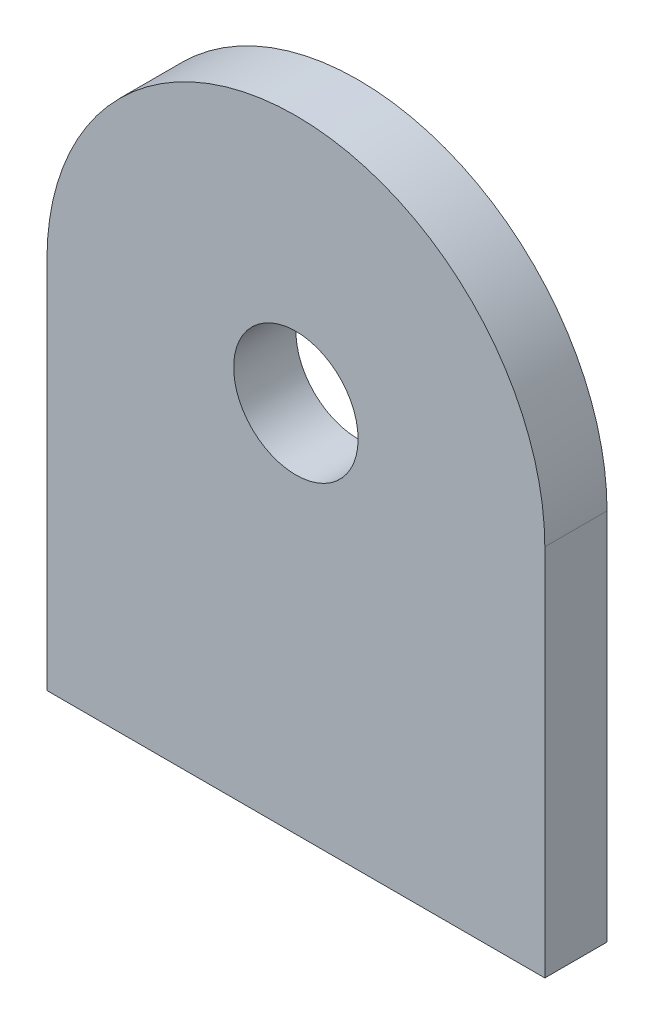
ISO-10303-21;
HEADER;
FILE_DESCRIPTION(('STEP AP214'),'2;1');
FILE_NAME('part.step','',(''),(''),'','','');
FILE_SCHEMA(('AUTOMOTIVE_DESIGN { 1 0 10303 214 1 1 1 1 }'));
ENDSEC;
DATA;
#1=APPLICATION_CONTEXT('core data for automotive mechanical design processes');
#2=APPLICATION_PROTOCOL_DEFINITION('international standard','automotive_design',2000,#1);
#3=PRODUCT_CONTEXT('',#1,'mechanical');
#4=PRODUCT('Part','Part','',(#3));
#5=PRODUCT_RELATED_PRODUCT_CATEGORY('part','',(#4));
#6=PRODUCT_DEFINITION_FORMATION('','',#4);
#7=PRODUCT_DEFINITION_CONTEXT('part definition',#1,'design');
#8=PRODUCT_DEFINITION('design','',#6,#7);
#9=PRODUCT_DEFINITION_SHAPE('','',#8);
#10=(LENGTH_UNIT() NAMED_UNIT(*) SI_UNIT(.MILLI.,.METRE.));
#11=(NAMED_UNIT(*) PLANE_ANGLE_UNIT() SI_UNIT($,.RADIAN.));
#12=(NAMED_UNIT(*) SI_UNIT($,.STERADIAN.) SOLID_ANGLE_UNIT());
#13=UNCERTAINTY_MEASURE_WITH_UNIT(LENGTH_MEASURE(1.E-05),#10,'distance_accuracy_value','');
#14=(GEOMETRIC_REPRESENTATION_CONTEXT(3) GLOBAL_UNCERTAINTY_ASSIGNED_CONTEXT((#13)) GLOBAL_UNIT_ASSIGNED_CONTEXT((#10,
#11,#12)) REPRESENTATION_CONTEXT('',''));
#15=CARTESIAN_POINT('',(0.,0.,0.));
#16=DIRECTION('',(0.,0.,1.));
#17=DIRECTION('',(1.,0.,0.));
#18=AXIS2_PLACEMENT_3D('',#15,#16,#17);
#19=CARTESIAN_POINT('',(0.,6.35000000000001,3.175));
#20=DIRECTION('',(0.,0.,-1.));
#21=DIRECTION('',(-1.,0.,0.));
#22=AXIS2_PLACEMENT_3D('',#19,#20,#21);
#23=CYLINDRICAL_SURFACE('',#22,25.4);
#24=CARTESIAN_POINT('',(0.,6.35000000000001,-3.175));
#25=DIRECTION('',(0.,0.,1.));
#26=DIRECTION('',(1.,0.,0.));
#27=AXIS2_PLACEMENT_3D('',#24,#25,#26);
#28=CIRCLE('',#27,25.4);
#29=CARTESIAN_POINT('',(25.4,6.35000000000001,-3.175));
#30=VERTEX_POINT('',#29);
#31=CARTESIAN_POINT('',(-25.4,6.35000000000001,-3.175));
#32=VERTEX_POINT('',#31);
#33=EDGE_CURVE('E96',#30,#32,#28,.T.);
#34=ORIENTED_EDGE('',*,*,#33,.T.);
#35=DIRECTION('',(0.,0.,-1.));
#36=VECTOR('',#35,1.);
#37=CARTESIAN_POINT('',(-25.4,6.35000000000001,3.175));
#38=LINE('',#37,#36);
#39=CARTESIAN_POINT('',(-25.4,6.35000000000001,3.175));
#40=VERTEX_POINT('',#39);
#41=EDGE_CURVE('E11',#40,#32,#38,.T.);
#42=ORIENTED_EDGE('',*,*,#41,.F.);
#43=CARTESIAN_POINT('',(0.,6.35000000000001,3.175));
#44=DIRECTION('',(0.,0.,1.));
#45=DIRECTION('',(1.,0.,0.));
#46=AXIS2_PLACEMENT_3D('',#43,#44,#45);
#47=CIRCLE('',#46,25.4);
#48=CARTESIAN_POINT('',(25.4,6.35000000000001,3.175));
#49=VERTEX_POINT('',#48);
#50=EDGE_CURVE('E82',#49,#40,#47,.T.);
#51=ORIENTED_EDGE('',*,*,#50,.F.);
#52=DIRECTION('',(0.,0.,-1.));
#53=VECTOR('',#52,1.);
#54=CARTESIAN_POINT('',(25.4,6.35000000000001,3.175));
#55=LINE('',#54,#53);
#56=EDGE_CURVE('E49',#49,#30,#55,.T.);
#57=ORIENTED_EDGE('',*,*,#56,.T.);
#58=EDGE_LOOP('',(#34,#42,#51,#57));
#59=FACE_BOUND('',#58,.T.);
#60=ADVANCED_FACE('F33',(#59),#23,.T.);
#61=CARTESIAN_POINT('',(-25.4,6.35000000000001,3.175));
#62=DIRECTION('',(1.,0.,0.));
#63=DIRECTION('',(0.,1.,0.));
#64=AXIS2_PLACEMENT_3D('',#61,#62,#63);
#65=PLANE('',#64);
#66=DIRECTION('',(0.,-1.,0.));
#67=VECTOR('',#66,1.);
#68=CARTESIAN_POINT('',(-25.4,6.35000000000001,-3.175));
#69=LINE('',#68,#67);
#70=CARTESIAN_POINT('',(-25.4,-31.75,-3.175));
#71=VERTEX_POINT('',#70);
#72=EDGE_CURVE('E87',#32,#71,#69,.T.);
#73=ORIENTED_EDGE('',*,*,#72,.T.);
#74=DIRECTION('',(0.,0.,-1.));
#75=VECTOR('',#74,1.);
#76=CARTESIAN_POINT('',(-25.4,-31.75,3.175));
#77=LINE('',#76,#75);
#78=CARTESIAN_POINT('',(-25.4,-31.75,3.175));
#79=VERTEX_POINT('',#78);
#80=EDGE_CURVE('E41',#79,#71,#77,.T.);
#81=ORIENTED_EDGE('',*,*,#80,.F.);
#82=DIRECTION('',(0.,-1.,0.));
#83=VECTOR('',#82,1.);
#84=CARTESIAN_POINT('',(-25.4,6.35000000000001,3.175));
#85=LINE('',#84,#83);
#86=EDGE_CURVE('E75',#40,#79,#85,.T.);
#87=ORIENTED_EDGE('',*,*,#86,.F.);
#88=ORIENTED_EDGE('',*,*,#41,.T.);
#89=EDGE_LOOP('',(#73,#81,#87,#88));
#90=FACE_BOUND('',#89,.T.);
#91=ADVANCED_FACE('F86',(#90),#65,.F.);
#92=CARTESIAN_POINT('',(-25.4,-31.75,3.175));
#93=DIRECTION('',(0.,1.,0.));
#94=DIRECTION('',(0.,0.,1.));
#95=AXIS2_PLACEMENT_3D('',#92,#93,#94);
#96=PLANE('',#95);
#97=DIRECTION('',(1.,0.,0.));
#98=VECTOR('',#97,1.);
#99=CARTESIAN_POINT('',(-25.4,-31.75,-3.175));
#100=LINE('',#99,#98);
#101=CARTESIAN_POINT('',(25.4,-31.75,-3.175));
#102=VERTEX_POINT('',#101);
#103=EDGE_CURVE('E100',#71,#102,#100,.T.);
#104=ORIENTED_EDGE('',*,*,#103,.T.);
#105=DIRECTION('',(0.,0.,-1.));
#106=VECTOR('',#105,1.);
#107=CARTESIAN_POINT('',(25.4,-31.75,3.175));
#108=LINE('',#107,#106);
#109=CARTESIAN_POINT('',(25.4,-31.75,3.175));
#110=VERTEX_POINT('',#109);
#111=EDGE_CURVE('E64',#110,#102,#108,.T.);
#112=ORIENTED_EDGE('',*,*,#111,.F.);
#113=DIRECTION('',(1.,0.,0.));
#114=VECTOR('',#113,1.);
#115=CARTESIAN_POINT('',(-25.4,-31.75,3.175));
#116=LINE('',#115,#114);
#117=EDGE_CURVE('E81',#79,#110,#116,.T.);
#118=ORIENTED_EDGE('',*,*,#117,.F.);
#119=ORIENTED_EDGE('',*,*,#80,.T.);
#120=EDGE_LOOP('',(#104,#112,#118,#119));
#121=FACE_BOUND('',#120,.T.);
#122=ADVANCED_FACE('F90',(#121),#96,.F.);
#123=CARTESIAN_POINT('',(25.4,6.35000000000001,3.175));
#124=DIRECTION('',(1.,0.,0.));
#125=DIRECTION('',(0.,1.,0.));
#126=AXIS2_PLACEMENT_3D('',#123,#124,#125);
#127=PLANE('',#126);
#128=DIRECTION('',(0.,-1.,0.));
#129=VECTOR('',#128,1.);
#130=CARTESIAN_POINT('',(25.4,6.35000000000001,-3.175));
#131=LINE('',#130,#129);
#132=EDGE_CURVE('E102',#30,#102,#131,.T.);
#133=ORIENTED_EDGE('',*,*,#132,.F.);
#134=ORIENTED_EDGE('',*,*,#56,.F.);
#135=DIRECTION('',(0.,-1.,0.));
#136=VECTOR('',#135,1.);
#137=CARTESIAN_POINT('',(25.4,6.35000000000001,3.175));
#138=LINE('',#137,#136);
#139=EDGE_CURVE('E91',#49,#110,#138,.T.);
#140=ORIENTED_EDGE('',*,*,#139,.T.);
#141=ORIENTED_EDGE('',*,*,#111,.T.);
#142=EDGE_LOOP('',(#133,#134,#140,#141));
#143=FACE_BOUND('',#142,.T.);
#144=ADVANCED_FACE('F123',(#143),#127,.T.);
#145=CARTESIAN_POINT('',(0.,6.35000000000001,3.175));
#146=DIRECTION('',(0.,0.,1.));
#147=DIRECTION('',(1.,0.,0.));
#148=AXIS2_PLACEMENT_3D('',#145,#146,#147);
#149=PLANE('',#148);
#150=CARTESIAN_POINT('',(0.,6.35000000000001,3.175));
#151=DIRECTION('',(0.,0.,1.));
#152=DIRECTION('',(1.,0.,0.));
#153=AXIS2_PLACEMENT_3D('',#150,#151,#152);
#154=CIRCLE('',#153,6.35);
#155=CARTESIAN_POINT('',(6.35,6.35000000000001,3.175));
#156=VERTEX_POINT('',#155);
#157=EDGE_CURVE('E108',#156,#156,#154,.T.);
#158=ORIENTED_EDGE('',*,*,#157,.F.);
#159=EDGE_LOOP('',(#158));
#160=FACE_BOUND('',#159,.T.);
#161=ORIENTED_EDGE('',*,*,#50,.T.);
#162=ORIENTED_EDGE('',*,*,#86,.T.);
#163=ORIENTED_EDGE('',*,*,#117,.T.);
#164=ORIENTED_EDGE('',*,*,#139,.F.);
#165=EDGE_LOOP('',(#161,#162,#163,#164));
#166=FACE_BOUND('',#165,.T.);
#167=ADVANCED_FACE('F78',(#160,#166),#149,.T.);
#168=CARTESIAN_POINT('',(0.,6.35000000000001,-3.175));
#169=DIRECTION('',(0.,0.,1.));
#170=DIRECTION('',(1.,0.,0.));
#171=AXIS2_PLACEMENT_3D('',#168,#169,#170);
#172=PLANE('',#171);
#173=CARTESIAN_POINT('',(0.,6.35000000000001,-3.175));
#174=DIRECTION('',(0.,0.,1.));
#175=DIRECTION('',(1.,0.,0.));
#176=AXIS2_PLACEMENT_3D('',#173,#174,#175);
#177=CIRCLE('',#176,6.35);
#178=CARTESIAN_POINT('',(6.35,6.35000000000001,-3.175));
#179=VERTEX_POINT('',#178);
#180=EDGE_CURVE('E98',#179,#179,#177,.T.);
#181=ORIENTED_EDGE('',*,*,#180,.T.);
#182=EDGE_LOOP('',(#181));
#183=FACE_BOUND('',#182,.T.);
#184=ORIENTED_EDGE('',*,*,#33,.F.);
#185=ORIENTED_EDGE('',*,*,#132,.T.);
#186=ORIENTED_EDGE('',*,*,#103,.F.);
#187=ORIENTED_EDGE('',*,*,#72,.F.);
#188=EDGE_LOOP('',(#184,#185,#186,#187));
#189=FACE_BOUND('',#188,.T.);
#190=ADVANCED_FACE('F114',(#183,#189),#172,.F.);
#191=CARTESIAN_POINT('',(0.,6.35000000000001,-3.175));
#192=DIRECTION('',(0.,0.,1.));
#193=DIRECTION('',(1.,0.,0.));
#194=AXIS2_PLACEMENT_3D('',#191,#192,#193);
#195=CYLINDRICAL_SURFACE('',#194,6.35);
#196=ORIENTED_EDGE('',*,*,#180,.F.);
#197=EDGE_LOOP('',(#196));
#198=FACE_BOUND('',#197,.T.);
#199=ORIENTED_EDGE('',*,*,#157,.T.);
#200=EDGE_LOOP('',(#199));
#201=FACE_BOUND('',#200,.T.);
#202=ADVANCED_FACE('F116',(#198,#201),#195,.F.);
#203=CLOSED_SHELL('',(#60,#91,#122,#144,#167,#190,#202));
#204=MANIFOLD_SOLID_BREP('B2',#203);
#205=ADVANCED_BREP_SHAPE_REPRESENTATION('',(#18,#204),#14);
#206=SHAPE_DEFINITION_REPRESENTATION(#9,#205);
ENDSEC;
END-ISO-10303-21;
